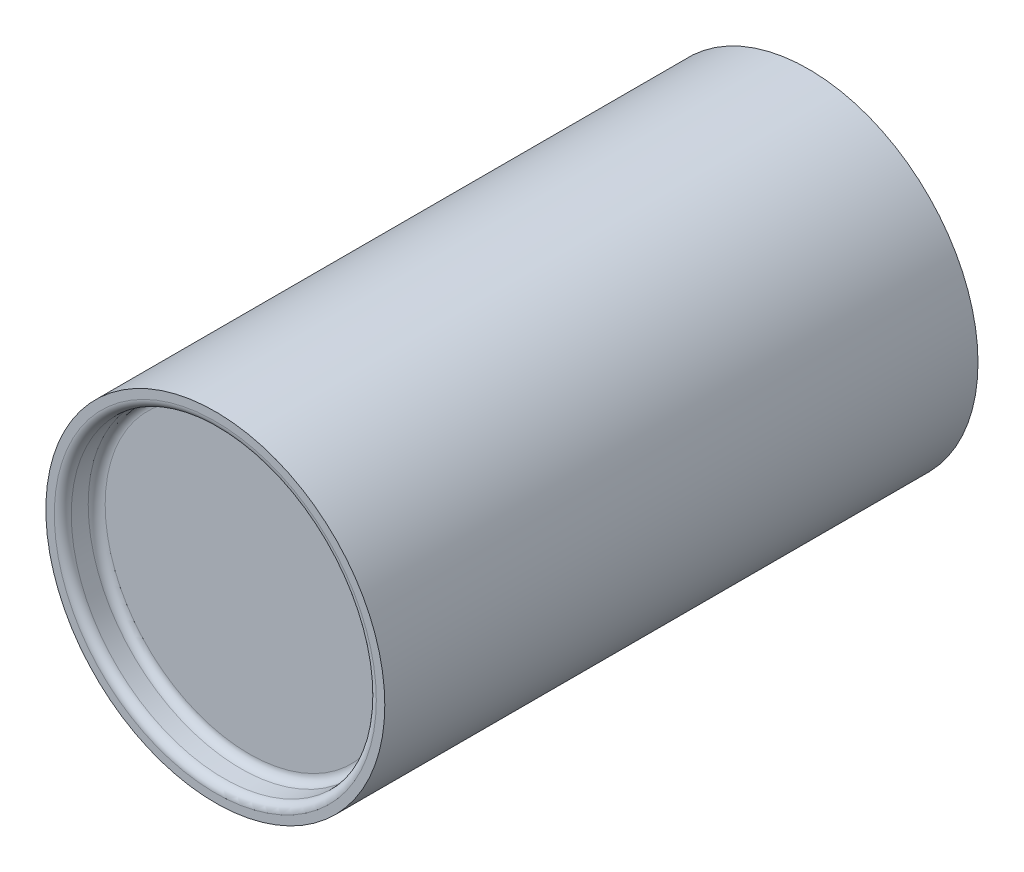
from build123d import *

# Parameters (mm, degrees)
ESQUISSE1_R             = 10
BOSS_EXTRU_1_DEPTH      = 35
ESQUISSE2_R             = 9
ENL_V_MAT_EXTRU_1_DEPTH = 2
ENL_V_START             = -2
ESQUISSE3_R             = 9
ENL_V_MAT_EXTRU_2_DEPTH = 2
CONG_1_R                = 0.5


with BuildPart() as part:
    # Esquisse1 → Boss.-Extru.1 (new body)
    with BuildSketch(Plane.XY):
        Circle(ESQUISSE1_R)
    extrude(amount=BOSS_EXTRU_1_DEPTH)

    # Esquisse2 → Enl_v. mat.-Extru.1 (cut)
    with BuildSketch(Plane(origin=(0, 0, 0), x_dir=(-1, 0, 0), z_dir=(0, 0, -1))):
        Circle(ESQUISSE2_R)
    extrude(amount=-ENL_V_MAT_EXTRU_1_DEPTH, mode=Mode.SUBTRACT)

    # Esquisse3 → Enl_v. mat.-Extru.2 (cut)
    with BuildSketch(Plane.XY.offset(35).offset(ENL_V_START)):
        with Locations(Location((0, 0, 0), (0, 0, 180))):
            Circle(ESQUISSE3_R)
    extrude(amount=ENL_V_MAT_EXTRU_2_DEPTH, mode=Mode.SUBTRACT)

    # Cong_1
    cong_1_edges = [part.edges().sort_by_distance(p)[0] for p in [
        (9, 0, 33),
        (9, 0, 35),
        (9, 0, 2),
        (9, 0, 0),
    ]]
    fillet(cong_1_edges, radius=CONG_1_R)


solid = part.part
